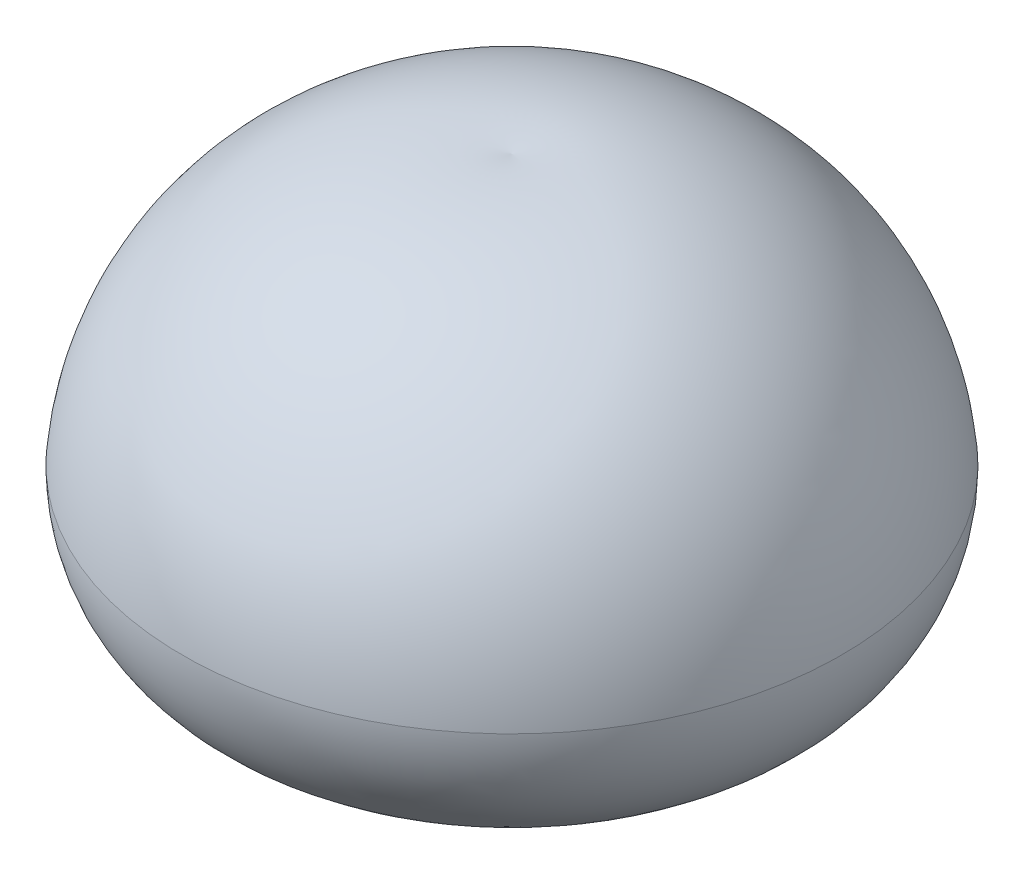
ISO-10303-21;
HEADER;
FILE_DESCRIPTION(('STEP AP214'),'2;1');
FILE_NAME('part.step','',(''),(''),'','','');
FILE_SCHEMA(('AUTOMOTIVE_DESIGN { 1 0 10303 214 1 1 1 1 }'));
ENDSEC;
DATA;
#1=APPLICATION_CONTEXT('core data for automotive mechanical design processes');
#2=APPLICATION_PROTOCOL_DEFINITION('international standard','automotive_design',2000,#1);
#3=PRODUCT_CONTEXT('',#1,'mechanical');
#4=PRODUCT('Part','Part','',(#3));
#5=PRODUCT_RELATED_PRODUCT_CATEGORY('part','',(#4));
#6=PRODUCT_DEFINITION_FORMATION('','',#4);
#7=PRODUCT_DEFINITION_CONTEXT('part definition',#1,'design');
#8=PRODUCT_DEFINITION('design','',#6,#7);
#9=PRODUCT_DEFINITION_SHAPE('','',#8);
#10=(LENGTH_UNIT() NAMED_UNIT(*) SI_UNIT(.MILLI.,.METRE.));
#11=(NAMED_UNIT(*) PLANE_ANGLE_UNIT() SI_UNIT($,.RADIAN.));
#12=(NAMED_UNIT(*) SI_UNIT($,.STERADIAN.) SOLID_ANGLE_UNIT());
#13=UNCERTAINTY_MEASURE_WITH_UNIT(LENGTH_MEASURE(1.E-05),#10,'distance_accuracy_value','');
#14=(GEOMETRIC_REPRESENTATION_CONTEXT(3) GLOBAL_UNCERTAINTY_ASSIGNED_CONTEXT((#13)) GLOBAL_UNIT_ASSIGNED_CONTEXT((#10,
#11,#12)) REPRESENTATION_CONTEXT('',''));
#15=CARTESIAN_POINT('',(0.,0.,0.));
#16=DIRECTION('',(0.,0.,1.));
#17=DIRECTION('',(1.,0.,0.));
#18=AXIS2_PLACEMENT_3D('',#15,#16,#17);
#19=CARTESIAN_POINT('',(0.,688.,-285.));
#20=DIRECTION('',(-1.,0.,0.));
#21=DIRECTION('',(0.,0.,-1.));
#22=AXIS2_PLACEMENT_3D('',#19,#20,#21);
#23=CIRCLE('',#22,1564.16910850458);
#24=TRIMMED_CURVE('',#23,(PARAMETER_VALUE(-1.75402522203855)),
(PARAMETER_VALUE(1.75402522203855)),.T.,.PARAMETER.);
#25=CARTESIAN_POINT('',(0.,688.,0.));
#26=DIRECTION('',(0.,-1.,0.));
#27=AXIS1_PLACEMENT('',#25,#26);
#28=SURFACE_OF_REVOLUTION('',#24,#27);
#29=CARTESIAN_POINT('',(0.,2243.52213578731,0.));
#30=DIRECTION('',(0.,-1.,0.));
#31=DIRECTION('',(0.,0.,-1.));
#32=AXIS2_PLACEMENT_3D('',#29,#30,#31);
#33=CIRCLE('',#32,120.756628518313);
#34=CARTESIAN_POINT('',(0.,2243.52213578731,-120.756628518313));
#35=VERTEX_POINT('',#34);
#36=EDGE_CURVE('E58',#35,#35,#33,.T.);
#37=ORIENTED_EDGE('',*,*,#36,.T.);
#38=EDGE_LOOP('',(#37));
#39=FACE_BOUND('',#38,.T.);
#40=CARTESIAN_POINT('',(0.,2225.98569564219,0.));
#41=VERTEX_POINT('',#40);
#42=VERTEX_LOOP('',#41);
#43=FACE_BOUND('',#42,.T.);
#44=ADVANCED_FACE('F35',(#39,#43),#28,.F.);
#45=CARTESIAN_POINT('',(0.,688.,-285.));
#46=DIRECTION('',(-1.,0.,0.));
#47=DIRECTION('',(0.,0.,-1.));
#48=AXIS2_PLACEMENT_3D('',#45,#46,#47);
#49=CIRCLE('',#48,2426.49920440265);
#50=TRIMMED_CURVE('',#49,(PARAMETER_VALUE(-1.68852122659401)),
(PARAMETER_VALUE(1.68852122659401)),.T.,.PARAMETER.);
#51=CARTESIAN_POINT('',(0.,688.,0.));
#52=DIRECTION('',(0.,-1.,0.));
#53=AXIS1_PLACEMENT('',#51,#52);
#54=SURFACE_OF_REVOLUTION('',#50,#53);
#55=CARTESIAN_POINT('',(0.,887.695404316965,0.));
#56=DIRECTION('',(0.,-1.,0.));
#57=DIRECTION('',(0.,0.,-1.));
#58=AXIS2_PLACEMENT_3D('',#55,#56,#57);
#59=CIRCLE('',#58,2703.26800302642);
#60=CARTESIAN_POINT('',(0.,887.695404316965,-2703.26800302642));
#61=VERTEX_POINT('',#60);
#62=EDGE_CURVE('E11',#61,#61,#59,.T.);
#63=ORIENTED_EDGE('',*,*,#62,.F.);
#64=EDGE_LOOP('',(#63));
#65=FACE_BOUND('',#64,.T.);
#66=CARTESIAN_POINT('',(0.,3097.70400443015,0.));
#67=VERTEX_POINT('',#66);
#68=VERTEX_LOOP('',#67);
#69=FACE_BOUND('',#68,.T.);
#70=ADVANCED_FACE('F49',(#65,#69),#54,.T.);
#71=CARTESIAN_POINT('',(0.,887.695404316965,0.));
#72=DIRECTION('',(0.,-1.,0.));
#73=DIRECTION('',(0.,0.,-1.));
#74=AXIS2_PLACEMENT_3D('',#71,#72,#73);
#75=TOROIDAL_SURFACE('',#74,1417.52891596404,1285.73908706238);
#76=CARTESIAN_POINT('',(0.,238.910620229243,0.));
#77=DIRECTION('',(0.,-1.,0.));
#78=DIRECTION('',(0.,0.,-1.));
#79=AXIS2_PLACEMENT_3D('',#76,#77,#78);
#80=CIRCLE('',#79,307.482383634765);
#81=CARTESIAN_POINT('',(0.,238.910620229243,-307.482383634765));
#82=VERTEX_POINT('',#81);
#83=EDGE_CURVE('E42',#82,#82,#80,.T.);
#84=ORIENTED_EDGE('',*,*,#83,.F.);
#85=EDGE_LOOP('',(#84));
#86=FACE_BOUND('',#85,.T.);
#87=ORIENTED_EDGE('',*,*,#62,.T.);
#88=EDGE_LOOP('',(#87));
#89=FACE_BOUND('',#88,.T.);
#90=ADVANCED_FACE('F54',(#86,#89),#75,.T.);
#91=CARTESIAN_POINT('',(0.,688.,0.));
#92=DIRECTION('',(0.,-1.,0.));
#93=DIRECTION('',(0.,0.,-1.));
#94=AXIS2_PLACEMENT_3D('',#91,#92,#93);
#95=DEGENERATE_TOROIDAL_SURFACE('',#94,285.,449.651785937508,.T.);
#96=ORIENTED_EDGE('',*,*,#83,.T.);
#97=EDGE_LOOP('',(#96));
#98=FACE_BOUND('',#97,.T.);
#99=CARTESIAN_POINT('',(0.,1046.47382147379,0.));
#100=DIRECTION('',(0.,-1.,0.));
#101=DIRECTION('',(0.,0.,-1.));
#102=AXIS2_PLACEMENT_3D('',#99,#100,#101);
#103=CIRCLE('',#102,556.446583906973);
#104=CARTESIAN_POINT('',(0.,1046.47382147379,-556.446583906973));
#105=VERTEX_POINT('',#104);
#106=EDGE_CURVE('E60',#105,#105,#103,.T.);
#107=ORIENTED_EDGE('',*,*,#106,.F.);
#108=EDGE_LOOP('',(#107));
#109=FACE_BOUND('',#108,.T.);
#110=ADVANCED_FACE('F67',(#98,#109),#95,.F.);
#111=CARTESIAN_POINT('',(0.,1263.,0.));
#112=DIRECTION('',(0.,-1.,0.));
#113=DIRECTION('',(0.,0.,-1.));
#114=AXIS2_PLACEMENT_3D('',#111,#112,#113);
#115=DEGENERATE_TOROIDAL_SURFACE('',#114,710.929214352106,1285.73908706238,.F.);
#116=ORIENTED_EDGE('',*,*,#106,.T.);
#117=EDGE_LOOP('',(#116));
#118=FACE_BOUND('',#117,.T.);
#119=ORIENTED_EDGE('',*,*,#36,.F.);
#120=EDGE_LOOP('',(#119));
#121=FACE_BOUND('',#120,.T.);
#122=ADVANCED_FACE('F77',(#118,#121),#115,.T.);
#123=CLOSED_SHELL('',(#44,#70,#90,#110,#122));
#124=MANIFOLD_SOLID_BREP('B2',#123);
#125=ADVANCED_BREP_SHAPE_REPRESENTATION('',(#18,#124),#14);
#126=SHAPE_DEFINITION_REPRESENTATION(#9,#125);
ENDSEC;
END-ISO-10303-21;
